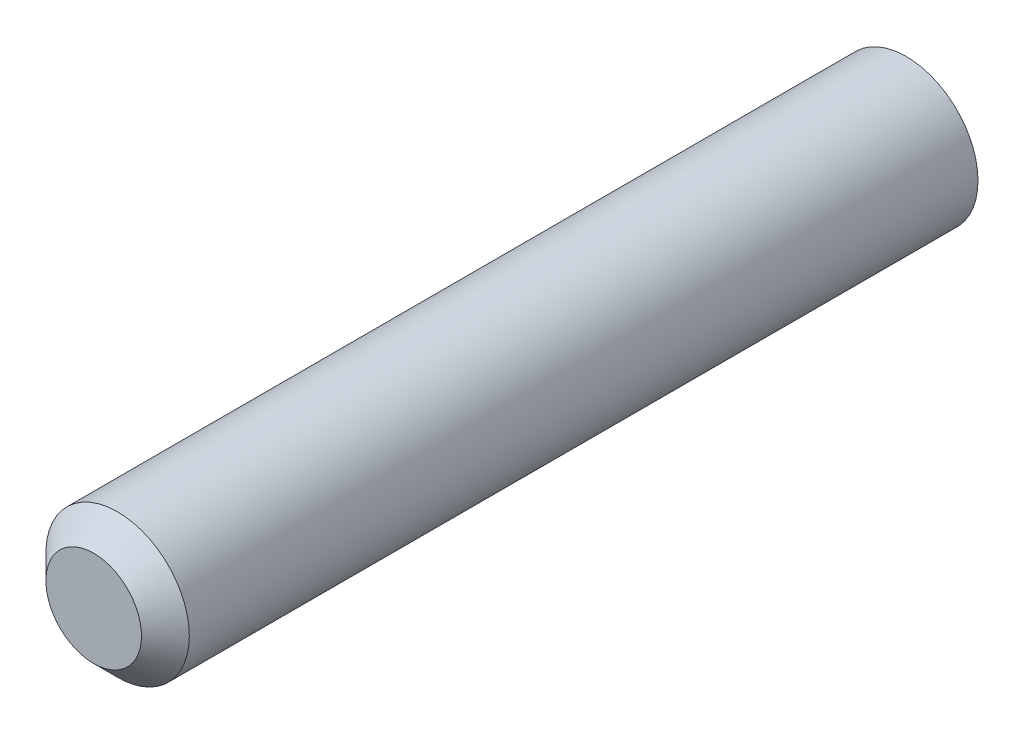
from build123d import *

# Parameters (mm, degrees)
ESQUISSE1_R      = 1.5
EXTRUSION1_DEPTH = 8.5
CHANFREIN1_SIZE  = 0.5


with BuildPart() as part:
    # Esquisse1 → Extrusion1 (new, symmetric)
    with BuildSketch(Plane.XY):
        Circle(ESQUISSE1_R)
    extrude(amount=EXTRUSION1_DEPTH, both=True)

    # Chanfrein1
    chanfrein1_edges = [part.edges().sort_by_distance(p)[0] for p in [
        (-1.5, 0, 8.5),
    ]]
    chamfer(chanfrein1_edges, length=CHANFREIN1_SIZE)


solid = part.part
